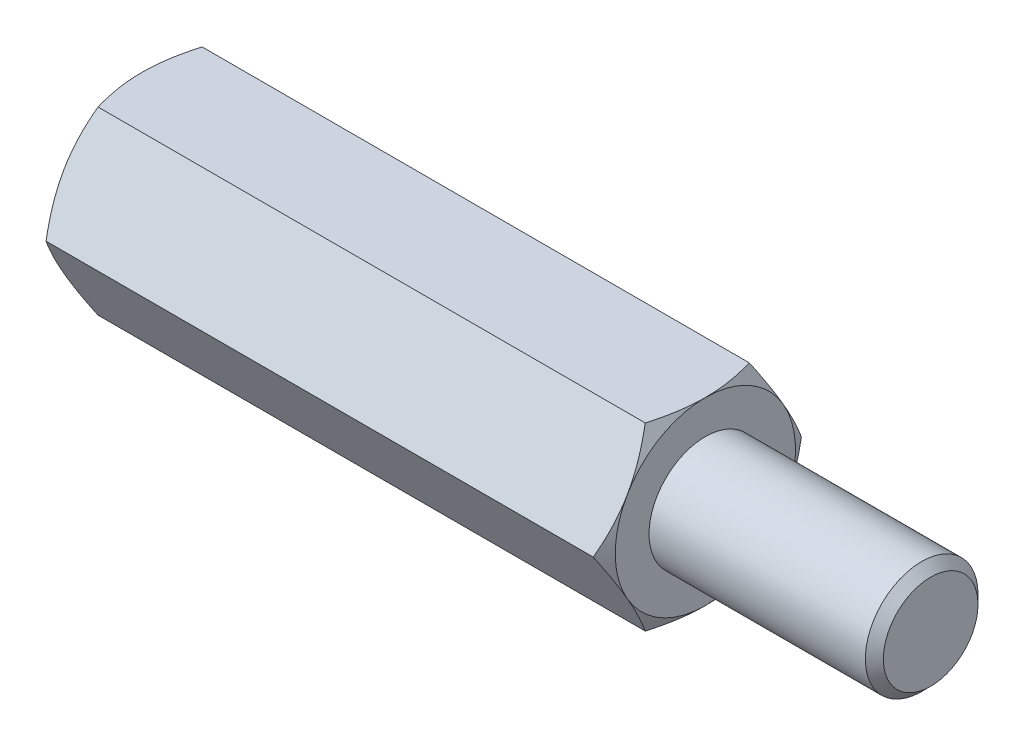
from build123d import *

# Parameters (mm, degrees)
EXTRUDE2_DEPTH = 12.5
SKETCH3_R      = 2.1
EXTRUDE3_DEPTH = 10
SKETCH5_R      = 2.5
EXTRUDE4_DEPTH = 10
CHAMFER1_SIZE  = 0.4


with BuildPart() as part:
    # Sketch1 → Extrude2 (new, symmetric)
    with BuildSketch(Plane(origin=(0, 0, 0), x_dir=(0, 0, -1), z_dir=(1, 0, 0))):
        Polygon((2.309401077, 4), (-2.309401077, 4), (-4.618802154, 0), (-2.309401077, -4), (2.309401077, -4), (4.618802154, 0), align=None)
    extrude(amount=EXTRUDE2_DEPTH, both=True)

    # Sketch2 → Cut-Revolve1 (revolve, cut)
    with BuildSketch(Plane.XY):
        with BuildLine():
            Line((-12.5, 4), (-11, 6.598076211))
            ThreePointArc((-11, 6.598076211), (-11.48810136, 7.776457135), (-12.5, 7))
            Line((-12.5, 7), (-12.5, 4))
        make_face()
    cut_revolve1 = revolve(axis=Axis((0, 0, 0), (1, 0, 0)), mode=Mode.SUBTRACT)

    # Mirror1: Cut-Revolve1 across plane
    add(cut_revolve1.mirror(Plane(origin=(0, 0, 0), x_dir=(0, 0, 1), z_dir=(1, 0, 0))), mode=Mode.SUBTRACT)

    # Sketch3 → Extrude3 (cut)
    with BuildSketch(Plane.ZY.offset(12.5)):
        Circle(SKETCH3_R)
    extrude(amount=-EXTRUDE3_DEPTH, mode=Mode.SUBTRACT)

    # Sketch4 → Cut-Revolve2 (revolve, cut)
    with BuildSketch(Plane.XY, mode=Mode.PRIVATE) as cut_revolve2_sk:
        Polygon((-2.5, 0), (-2.5, 2.1), (-1.287564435, 0), align=None)
    revolve(cut_revolve2_sk.sketch.rotate(Axis((-1.287564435, 0, 0), (-1, 0, 0)), 270), axis=Axis((-1.287564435, 0, 0), (-1, 0, 0)), mode=Mode.SUBTRACT)

    # Sketch5 → Extrude4 (add)
    with BuildSketch(Plane(origin=(12.5, 0, 0), x_dir=(0, 0, -1), z_dir=(1, 0, 0))):
        Circle(SKETCH5_R)
    extrude(amount=EXTRUDE4_DEPTH)

    # Chamfer1
    chamfer1_edges = [part.edges().sort_by_distance(p)[0] for p in [
        (22.5, 0, 2.5),
    ]]
    chamfer(chamfer1_edges, length=CHAMFER1_SIZE)


solid = part.part
